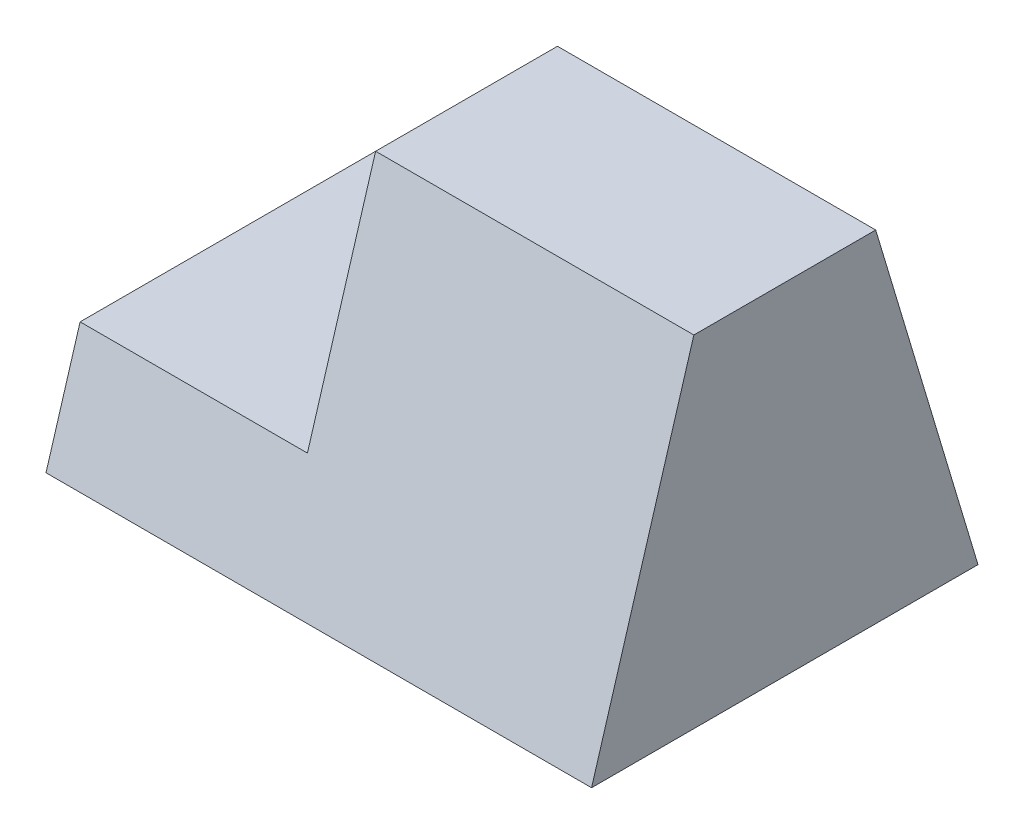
from build123d import *

# Parameters (mm, degrees)
EXTRUDE_1_DEPTH     = 120
CUT_EXTRUDE_1_DEPTH = 50


with BuildPart() as part:
    # Sketch 1 → Extrude 1 (new body)
    with BuildSketch(Plane(origin=(0, 0, 0), x_dir=(0, 0, -1), z_dir=(1, 0, 0))):
        Polygon((-42.5, 0), (42.5, 0), (20, 75), (-20, 75), align=None)
    extrude(amount=EXTRUDE_1_DEPTH)

    # Sketch 2 → Cut-Extrude 1 (cut)
    with BuildSketch(Plane.ZY):
        Polygon((-35, 25), (35, 25), (20, 75), (-20, 75), align=None)
    extrude(amount=-CUT_EXTRUDE_1_DEPTH, mode=Mode.SUBTRACT)


solid = part.part
